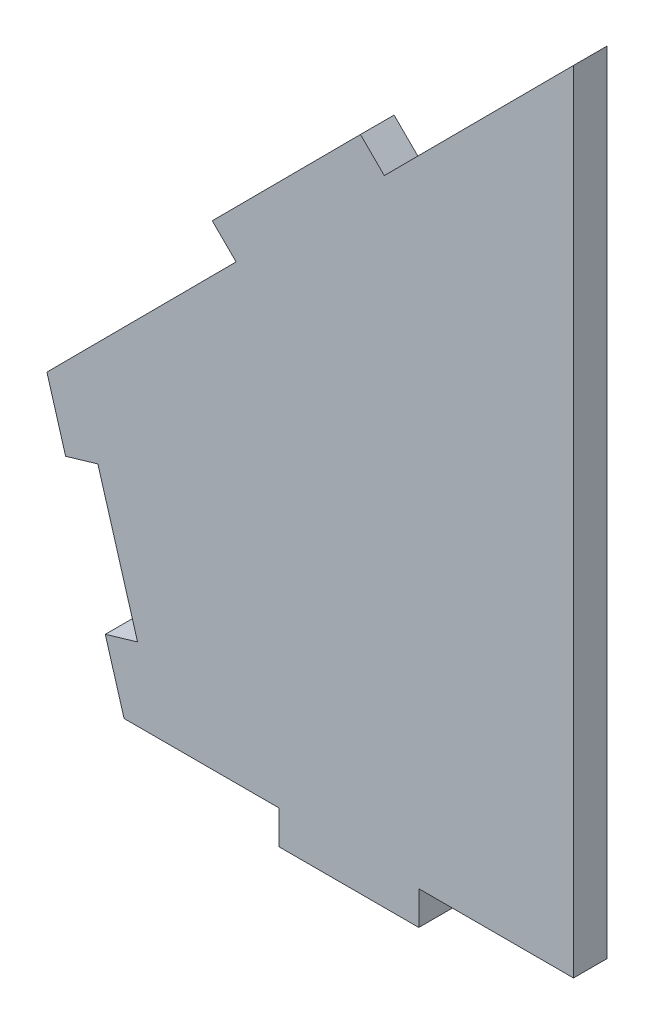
ISO-10303-21;
HEADER;
FILE_DESCRIPTION(('STEP AP214'),'2;1');
FILE_NAME('part.step','',(''),(''),'','','');
FILE_SCHEMA(('AUTOMOTIVE_DESIGN { 1 0 10303 214 1 1 1 1 }'));
ENDSEC;
DATA;
#1=APPLICATION_CONTEXT('core data for automotive mechanical design processes');
#2=APPLICATION_PROTOCOL_DEFINITION('international standard','automotive_design',2000,#1);
#3=PRODUCT_CONTEXT('',#1,'mechanical');
#4=PRODUCT('Part','Part','',(#3));
#5=PRODUCT_RELATED_PRODUCT_CATEGORY('part','',(#4));
#6=PRODUCT_DEFINITION_FORMATION('','',#4);
#7=PRODUCT_DEFINITION_CONTEXT('part definition',#1,'design');
#8=PRODUCT_DEFINITION('design','',#6,#7);
#9=PRODUCT_DEFINITION_SHAPE('','',#8);
#10=(LENGTH_UNIT() NAMED_UNIT(*) SI_UNIT(.MILLI.,.METRE.));
#11=(NAMED_UNIT(*) PLANE_ANGLE_UNIT() SI_UNIT($,.RADIAN.));
#12=(NAMED_UNIT(*) SI_UNIT($,.STERADIAN.) SOLID_ANGLE_UNIT());
#13=UNCERTAINTY_MEASURE_WITH_UNIT(LENGTH_MEASURE(1.E-05),#10,'distance_accuracy_value','');
#14=(GEOMETRIC_REPRESENTATION_CONTEXT(3) GLOBAL_UNCERTAINTY_ASSIGNED_CONTEXT((#13)) GLOBAL_UNIT_ASSIGNED_CONTEXT((#10,
#11,#12)) REPRESENTATION_CONTEXT('',''));
#15=CARTESIAN_POINT('',(0.,0.,0.));
#16=DIRECTION('',(0.,0.,1.));
#17=DIRECTION('',(1.,0.,0.));
#18=AXIS2_PLACEMENT_3D('',#15,#16,#17);
#19=CARTESIAN_POINT('',(-14.8880123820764,0.,1.524));
#20=DIRECTION('',(1.,0.,0.));
#21=DIRECTION('',(0.,0.,-1.));
#22=AXIS2_PLACEMENT_3D('',#19,#20,#21);
#23=PLANE('',#22);
#24=DIRECTION('',(0.,-1.,0.));
#25=VECTOR('',#24,1.);
#26=CARTESIAN_POINT('',(-14.8880123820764,0.,0.));
#27=LINE('',#26,#25);
#28=CARTESIAN_POINT('',(-14.8880123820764,10.5504707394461,0.));
#29=VERTEX_POINT('',#28);
#30=CARTESIAN_POINT('',(-14.8880123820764,9.02647073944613,0.));
#31=VERTEX_POINT('',#30);
#32=EDGE_CURVE('E185',#29,#31,#27,.T.);
#33=ORIENTED_EDGE('',*,*,#32,.T.);
#34=DIRECTION('',(0.,0.,-1.));
#35=VECTOR('',#34,1.);
#36=CARTESIAN_POINT('',(-14.8880123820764,9.02647073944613,1.524));
#37=LINE('',#36,#35);
#38=CARTESIAN_POINT('',(-14.8880123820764,9.02647073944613,1.524));
#39=VERTEX_POINT('',#38);
#40=EDGE_CURVE('E11',#39,#31,#37,.T.);
#41=ORIENTED_EDGE('',*,*,#40,.F.);
#42=DIRECTION('',(0.,-1.,0.));
#43=VECTOR('',#42,1.);
#44=CARTESIAN_POINT('',(-14.8880123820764,0.,1.524));
#45=LINE('',#44,#43);
#46=CARTESIAN_POINT('',(-14.8880123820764,10.5504707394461,1.524));
#47=VERTEX_POINT('',#46);
#48=EDGE_CURVE('E221',#47,#39,#45,.T.);
#49=ORIENTED_EDGE('',*,*,#48,.F.);
#50=DIRECTION('',(0.,0.,-1.));
#51=VECTOR('',#50,1.);
#52=CARTESIAN_POINT('',(-14.8880123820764,10.5504707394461,1.524));
#53=LINE('',#52,#51);
#54=EDGE_CURVE('E184',#47,#29,#53,.T.);
#55=ORIENTED_EDGE('',*,*,#54,.T.);
#56=EDGE_LOOP('',(#33,#41,#49,#55));
#57=FACE_BOUND('',#56,.T.);
#58=ADVANCED_FACE('F40',(#57),#23,.F.);
#59=CARTESIAN_POINT('',(0.,9.02647073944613,1.524));
#60=DIRECTION('',(0.,1.,0.));
#61=DIRECTION('',(0.,0.,1.));
#62=AXIS2_PLACEMENT_3D('',#59,#60,#61);
#63=PLANE('',#62);
#64=DIRECTION('',(1.,0.,0.));
#65=VECTOR('',#64,1.);
#66=CARTESIAN_POINT('',(0.,9.02647073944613,0.));
#67=LINE('',#66,#65);
#68=CARTESIAN_POINT('',(-8.53801238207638,9.02647073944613,0.));
#69=VERTEX_POINT('',#68);
#70=EDGE_CURVE('E188',#31,#69,#67,.T.);
#71=ORIENTED_EDGE('',*,*,#70,.T.);
#72=DIRECTION('',(0.,0.,-1.));
#73=VECTOR('',#72,1.);
#74=CARTESIAN_POINT('',(-8.53801238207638,9.02647073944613,1.524));
#75=LINE('',#74,#73);
#76=CARTESIAN_POINT('',(-8.53801238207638,9.02647073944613,1.524));
#77=VERTEX_POINT('',#76);
#78=EDGE_CURVE('E48',#77,#69,#75,.T.);
#79=ORIENTED_EDGE('',*,*,#78,.F.);
#80=DIRECTION('',(1.,0.,0.));
#81=VECTOR('',#80,1.);
#82=CARTESIAN_POINT('',(0.,9.02647073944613,1.524));
#83=LINE('',#82,#81);
#84=EDGE_CURVE('E122',#39,#77,#83,.T.);
#85=ORIENTED_EDGE('',*,*,#84,.F.);
#86=ORIENTED_EDGE('',*,*,#40,.T.);
#87=EDGE_LOOP('',(#71,#79,#85,#86));
#88=FACE_BOUND('',#87,.T.);
#89=ADVANCED_FACE('F256',(#88),#63,.F.);
#90=CARTESIAN_POINT('',(-8.53801238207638,0.,1.524));
#91=DIRECTION('',(1.,0.,0.));
#92=DIRECTION('',(0.,0.,-1.));
#93=AXIS2_PLACEMENT_3D('',#90,#91,#92);
#94=PLANE('',#93);
#95=DIRECTION('',(0.,-1.,0.));
#96=VECTOR('',#95,1.);
#97=CARTESIAN_POINT('',(-8.53801238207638,0.,0.));
#98=LINE('',#97,#96);
#99=CARTESIAN_POINT('',(-8.53801238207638,10.5504707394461,0.));
#100=VERTEX_POINT('',#99);
#101=EDGE_CURVE('E191',#100,#69,#98,.T.);
#102=ORIENTED_EDGE('',*,*,#101,.F.);
#103=DIRECTION('',(0.,0.,-1.));
#104=VECTOR('',#103,1.);
#105=CARTESIAN_POINT('',(-8.53801238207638,10.5504707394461,1.524));
#106=LINE('',#105,#104);
#107=CARTESIAN_POINT('',(-8.53801238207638,10.5504707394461,1.524));
#108=VERTEX_POINT('',#107);
#109=EDGE_CURVE('E249',#108,#100,#106,.T.);
#110=ORIENTED_EDGE('',*,*,#109,.F.);
#111=DIRECTION('',(0.,-1.,0.));
#112=VECTOR('',#111,1.);
#113=CARTESIAN_POINT('',(-8.53801238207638,0.,1.524));
#114=LINE('',#113,#112);
#115=EDGE_CURVE('E255',#108,#77,#114,.T.);
#116=ORIENTED_EDGE('',*,*,#115,.T.);
#117=ORIENTED_EDGE('',*,*,#78,.T.);
#118=EDGE_LOOP('',(#102,#110,#116,#117));
#119=FACE_BOUND('',#118,.T.);
#120=ADVANCED_FACE('F253',(#119),#94,.T.);
#121=CARTESIAN_POINT('',(0.,10.5504707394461,1.524));
#122=DIRECTION('',(0.,1.,0.));
#123=DIRECTION('',(0.,0.,1.));
#124=AXIS2_PLACEMENT_3D('',#121,#122,#123);
#125=PLANE('',#124);
#126=DIRECTION('',(1.,0.,0.));
#127=VECTOR('',#126,1.);
#128=CARTESIAN_POINT('',(0.,10.5504707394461,0.));
#129=LINE('',#128,#127);
#130=CARTESIAN_POINT('',(-1.524,10.5504707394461,0.));
#131=VERTEX_POINT('',#130);
#132=EDGE_CURVE('E194',#100,#131,#129,.T.);
#133=ORIENTED_EDGE('',*,*,#132,.T.);
#134=DIRECTION('',(0.,0.,-1.));
#135=VECTOR('',#134,1.);
#136=CARTESIAN_POINT('',(-1.524,10.5504707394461,1.524));
#137=LINE('',#136,#135);
#138=CARTESIAN_POINT('',(-1.524,10.5504707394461,1.524));
#139=VERTEX_POINT('',#138);
#140=EDGE_CURVE('E246',#139,#131,#137,.T.);
#141=ORIENTED_EDGE('',*,*,#140,.F.);
#142=DIRECTION('',(1.,0.,0.));
#143=VECTOR('',#142,1.);
#144=CARTESIAN_POINT('',(0.,10.5504707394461,1.524));
#145=LINE('',#144,#143);
#146=EDGE_CURVE('E275',#108,#139,#145,.T.);
#147=ORIENTED_EDGE('',*,*,#146,.F.);
#148=ORIENTED_EDGE('',*,*,#109,.T.);
#149=EDGE_LOOP('',(#133,#141,#147,#148));
#150=FACE_BOUND('',#149,.T.);
#151=ADVANCED_FACE('F266',(#150),#125,.F.);
#152=CARTESIAN_POINT('',(-1.524,0.,1.524));
#153=DIRECTION('',(-1.,0.,0.));
#154=DIRECTION('',(0.,-1.,0.));
#155=AXIS2_PLACEMENT_3D('',#152,#153,#154);
#156=PLANE('',#155);
#157=DIRECTION('',(0.,1.,0.));
#158=VECTOR('',#157,1.);
#159=CARTESIAN_POINT('',(-1.524,0.,0.));
#160=LINE('',#159,#158);
#161=CARTESIAN_POINT('',(-1.524,46.3839410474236,0.));
#162=VERTEX_POINT('',#161);
#163=EDGE_CURVE('E196',#131,#162,#160,.T.);
#164=ORIENTED_EDGE('',*,*,#163,.T.);
#165=DIRECTION('',(0.,0.,-1.));
#166=VECTOR('',#165,1.);
#167=CARTESIAN_POINT('',(-1.524,46.3839410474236,1.524));
#168=LINE('',#167,#166);
#169=CARTESIAN_POINT('',(-1.524,46.3839410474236,1.524));
#170=VERTEX_POINT('',#169);
#171=EDGE_CURVE('E243',#170,#162,#168,.T.);
#172=ORIENTED_EDGE('',*,*,#171,.F.);
#173=DIRECTION('',(0.,1.,0.));
#174=VECTOR('',#173,1.);
#175=CARTESIAN_POINT('',(-1.524,0.,1.524));
#176=LINE('',#175,#174);
#177=EDGE_CURVE('E272',#139,#170,#176,.T.);
#178=ORIENTED_EDGE('',*,*,#177,.F.);
#179=ORIENTED_EDGE('',*,*,#140,.T.);
#180=EDGE_LOOP('',(#164,#172,#178,#179));
#181=FACE_BOUND('',#180,.T.);
#182=ADVANCED_FACE('F270',(#181),#156,.F.);
#183=CARTESIAN_POINT('',(-23.9570480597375,23.8537002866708,1.524));
#184=DIRECTION('',(0.708633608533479,-0.705576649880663,0.));
#185=DIRECTION('',(0.705576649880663,0.708633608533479,0.));
#186=AXIS2_PLACEMENT_3D('',#183,#184,#185);
#187=PLANE('',#186);
#188=DIRECTION('',(-0.705576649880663,-0.708633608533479,0.));
#189=VECTOR('',#188,1.);
#190=CARTESIAN_POINT('',(-23.9570480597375,23.8537002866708,0.));
#191=LINE('',#190,#189);
#192=CARTESIAN_POINT('',(-10.1022613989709,37.7685137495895,0.));
#193=VERTEX_POINT('',#192);
#194=EDGE_CURVE('E198',#162,#193,#191,.T.);
#195=ORIENTED_EDGE('',*,*,#194,.T.);
#196=DIRECTION('',(0.,0.,-1.));
#197=VECTOR('',#196,1.);
#198=CARTESIAN_POINT('',(-10.1022613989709,37.7685137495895,1.524));
#199=LINE('',#198,#197);
#200=CARTESIAN_POINT('',(-10.1022613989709,37.7685137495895,1.524));
#201=VERTEX_POINT('',#200);
#202=EDGE_CURVE('E240',#201,#193,#199,.T.);
#203=ORIENTED_EDGE('',*,*,#202,.F.);
#204=DIRECTION('',(-0.705576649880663,-0.708633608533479,0.));
#205=VECTOR('',#204,1.);
#206=CARTESIAN_POINT('',(-23.9570480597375,23.8537002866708,1.524));
#207=LINE('',#206,#205);
#208=EDGE_CURVE('E274',#170,#201,#207,.T.);
#209=ORIENTED_EDGE('',*,*,#208,.F.);
#210=ORIENTED_EDGE('',*,*,#171,.T.);
#211=EDGE_LOOP('',(#195,#203,#209,#210));
#212=FACE_BOUND('',#211,.T.);
#213=ADVANCED_FACE('F326',(#212),#187,.F.);
#214=CARTESIAN_POINT('',(13.8547866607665,13.9148134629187,1.524));
#215=DIRECTION('',(-0.705576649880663,-0.708633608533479,0.));
#216=DIRECTION('',(0.708633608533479,-0.705576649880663,0.));
#217=AXIS2_PLACEMENT_3D('',#214,#215,#216);
#218=PLANE('',#217);
#219=DIRECTION('',(-0.708633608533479,0.705576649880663,0.));
#220=VECTOR('',#219,1.);
#221=CARTESIAN_POINT('',(13.8547866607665,13.9148134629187,0.));
#222=LINE('',#221,#220);
#223=CARTESIAN_POINT('',(-11.1822190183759,38.8438125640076,0.));
#224=VERTEX_POINT('',#223);
#225=EDGE_CURVE('E200',#193,#224,#222,.T.);
#226=ORIENTED_EDGE('',*,*,#225,.T.);
#227=DIRECTION('',(0.,0.,-1.));
#228=VECTOR('',#227,1.);
#229=CARTESIAN_POINT('',(-11.1822190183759,38.8438125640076,1.524));
#230=LINE('',#229,#228);
#231=CARTESIAN_POINT('',(-11.1822190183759,38.8438125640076,1.524));
#232=VERTEX_POINT('',#231);
#233=EDGE_CURVE('E237',#232,#224,#230,.T.);
#234=ORIENTED_EDGE('',*,*,#233,.F.);
#235=DIRECTION('',(-0.708633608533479,0.705576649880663,0.));
#236=VECTOR('',#235,1.);
#237=CARTESIAN_POINT('',(13.8547866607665,13.9148134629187,1.524));
#238=LINE('',#237,#236);
#239=EDGE_CURVE('E277',#201,#232,#238,.T.);
#240=ORIENTED_EDGE('',*,*,#239,.F.);
#241=ORIENTED_EDGE('',*,*,#202,.T.);
#242=EDGE_LOOP('',(#226,#234,#240,#241));
#243=FACE_BOUND('',#242,.T.);
#244=ADVANCED_FACE('F329',(#243),#218,.F.);
#245=CARTESIAN_POINT('',(-25.0370056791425,24.928999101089,1.524));
#246=DIRECTION('',(0.708633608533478,-0.705576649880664,0.));
#247=DIRECTION('',(0.705576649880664,0.708633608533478,0.));
#248=AXIS2_PLACEMENT_3D('',#245,#246,#247);
#249=PLANE('',#248);
#250=DIRECTION('',(-0.705576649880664,-0.708633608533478,0.));
#251=VECTOR('',#250,1.);
#252=CARTESIAN_POINT('',(-25.0370056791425,24.928999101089,0.));
#253=LINE('',#252,#251);
#254=CARTESIAN_POINT('',(-17.9028366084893,32.0940774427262,0.));
#255=VERTEX_POINT('',#254);
#256=EDGE_CURVE('E202',#224,#255,#253,.T.);
#257=ORIENTED_EDGE('',*,*,#256,.T.);
#258=DIRECTION('',(0.,0.,-1.));
#259=VECTOR('',#258,1.);
#260=CARTESIAN_POINT('',(-17.9028366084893,32.0940774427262,1.524));
#261=LINE('',#260,#259);
#262=CARTESIAN_POINT('',(-17.9028366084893,32.0940774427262,1.524));
#263=VERTEX_POINT('',#262);
#264=EDGE_CURVE('E235',#263,#255,#261,.T.);
#265=ORIENTED_EDGE('',*,*,#264,.F.);
#266=DIRECTION('',(-0.705576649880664,-0.708633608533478,0.));
#267=VECTOR('',#266,1.);
#268=CARTESIAN_POINT('',(-25.0370056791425,24.928999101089,1.524));
#269=LINE('',#268,#267);
#270=EDGE_CURVE('E283',#232,#263,#269,.T.);
#271=ORIENTED_EDGE('',*,*,#270,.F.);
#272=ORIENTED_EDGE('',*,*,#233,.T.);
#273=EDGE_LOOP('',(#257,#265,#271,#272));
#274=FACE_BOUND('',#273,.T.);
#275=ADVANCED_FACE('F333',(#274),#249,.F.);
#276=CARTESIAN_POINT('',(7.1341690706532,7.16507834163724,1.524));
#277=DIRECTION('',(-0.705576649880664,-0.708633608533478,0.));
#278=DIRECTION('',(0.708633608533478,-0.705576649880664,0.));
#279=AXIS2_PLACEMENT_3D('',#276,#277,#278);
#280=PLANE('',#279);
#281=DIRECTION('',(-0.708633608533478,0.705576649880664,0.));
#282=VECTOR('',#281,1.);
#283=CARTESIAN_POINT('',(7.1341690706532,7.16507834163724,0.));
#284=LINE('',#283,#282);
#285=CARTESIAN_POINT('',(-16.8228789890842,31.0187786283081,0.));
#286=VERTEX_POINT('',#285);
#287=EDGE_CURVE('E205',#286,#255,#284,.T.);
#288=ORIENTED_EDGE('',*,*,#287,.F.);
#289=DIRECTION('',(0.,0.,-1.));
#290=VECTOR('',#289,1.);
#291=CARTESIAN_POINT('',(-16.8228789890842,31.0187786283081,1.524));
#292=LINE('',#291,#290);
#293=CARTESIAN_POINT('',(-16.8228789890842,31.0187786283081,1.524));
#294=VERTEX_POINT('',#293);
#295=EDGE_CURVE('E233',#294,#286,#292,.T.);
#296=ORIENTED_EDGE('',*,*,#295,.F.);
#297=DIRECTION('',(-0.708633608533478,0.705576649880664,0.));
#298=VECTOR('',#297,1.);
#299=CARTESIAN_POINT('',(7.1341690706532,7.16507834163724,1.524));
#300=LINE('',#299,#298);
#301=EDGE_CURVE('E285',#294,#263,#300,.T.);
#302=ORIENTED_EDGE('',*,*,#301,.T.);
#303=ORIENTED_EDGE('',*,*,#264,.T.);
#304=EDGE_LOOP('',(#288,#296,#302,#303));
#305=FACE_BOUND('',#304,.T.);
#306=ADVANCED_FACE('F337',(#305),#280,.T.);
#307=CARTESIAN_POINT('',(-23.9570480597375,23.8537002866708,1.524));
#308=DIRECTION('',(0.708633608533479,-0.705576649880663,0.));
#309=DIRECTION('',(0.705576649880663,0.708633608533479,0.));
#310=AXIS2_PLACEMENT_3D('',#307,#308,#309);
#311=PLANE('',#310);
#312=DIRECTION('',(-0.705576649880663,-0.708633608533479,0.));
#313=VECTOR('',#312,1.);
#314=CARTESIAN_POINT('',(-23.9570480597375,23.8537002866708,0.));
#315=LINE('',#314,#313);
#316=CARTESIAN_POINT('',(-25.4011403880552,22.403351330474,0.));
#317=VERTEX_POINT('',#316);
#318=EDGE_CURVE('E208',#286,#317,#315,.T.);
#319=ORIENTED_EDGE('',*,*,#318,.T.);
#320=DIRECTION('',(0.,0.,-1.));
#321=VECTOR('',#320,1.);
#322=CARTESIAN_POINT('',(-25.4011403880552,22.403351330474,1.524));
#323=LINE('',#322,#321);
#324=CARTESIAN_POINT('',(-25.4011403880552,22.403351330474,1.524));
#325=VERTEX_POINT('',#324);
#326=EDGE_CURVE('E230',#325,#317,#323,.T.);
#327=ORIENTED_EDGE('',*,*,#326,.F.);
#328=DIRECTION('',(-0.705576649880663,-0.708633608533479,0.));
#329=VECTOR('',#328,1.);
#330=CARTESIAN_POINT('',(-23.9570480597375,23.8537002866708,1.524));
#331=LINE('',#330,#329);
#332=EDGE_CURVE('E288',#294,#325,#331,.T.);
#333=ORIENTED_EDGE('',*,*,#332,.F.);
#334=ORIENTED_EDGE('',*,*,#295,.T.);
#335=EDGE_LOOP('',(#319,#327,#333,#334));
#336=FACE_BOUND('',#335,.T.);
#337=ADVANCED_FACE('F341',(#336),#311,.F.);
#338=CARTESIAN_POINT('',(-17.2813243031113,-5.10165874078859,1.524));
#339=DIRECTION('',(0.959080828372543,0.283132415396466,0.));
#340=DIRECTION('',(-0.283132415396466,0.959080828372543,0.));
#341=AXIS2_PLACEMENT_3D('',#338,#339,#340);
#342=PLANE('',#341);
#343=DIRECTION('',(0.283132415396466,-0.959080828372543,0.));
#344=VECTOR('',#343,1.);
#345=CARTESIAN_POINT('',(-17.2813243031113,-5.10165874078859,0.));
#346=LINE('',#345,#344);
#347=CARTESIAN_POINT('',(-24.5505279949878,19.5219926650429,0.));
#348=VERTEX_POINT('',#347);
#349=EDGE_CURVE('E210',#317,#348,#346,.T.);
#350=ORIENTED_EDGE('',*,*,#349,.T.);
#351=DIRECTION('',(0.,0.,-1.));
#352=VECTOR('',#351,1.);
#353=CARTESIAN_POINT('',(-24.5505279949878,19.5219926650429,1.524));
#354=LINE('',#353,#352);
#355=CARTESIAN_POINT('',(-24.5505279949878,19.5219926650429,1.524));
#356=VERTEX_POINT('',#355);
#357=EDGE_CURVE('E227',#356,#348,#354,.T.);
#358=ORIENTED_EDGE('',*,*,#357,.F.);
#359=DIRECTION('',(0.283132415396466,-0.959080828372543,0.));
#360=VECTOR('',#359,1.);
#361=CARTESIAN_POINT('',(-17.2813243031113,-5.10165874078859,1.524));
#362=LINE('',#361,#360);
#363=EDGE_CURVE('E290',#325,#356,#362,.T.);
#364=ORIENTED_EDGE('',*,*,#363,.F.);
#365=ORIENTED_EDGE('',*,*,#326,.T.);
#366=EDGE_LOOP('',(#350,#358,#364,#365));
#367=FACE_BOUND('',#366,.T.);
#368=ADVANCED_FACE('F345',(#367),#342,.F.);
#369=CARTESIAN_POINT('',(-7.26920369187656,24.6236514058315,1.524));
#370=DIRECTION('',(-0.283132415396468,0.959080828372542,0.));
#371=DIRECTION('',(-0.959080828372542,-0.283132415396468,0.));
#372=AXIS2_PLACEMENT_3D('',#369,#370,#371);
#373=PLANE('',#372);
#374=DIRECTION('',(0.959080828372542,0.283132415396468,0.));
#375=VECTOR('',#374,1.);
#376=CARTESIAN_POINT('',(-7.26920369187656,24.6236514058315,0.));
#377=LINE('',#376,#375);
#378=CARTESIAN_POINT('',(-23.088888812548,19.9534864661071,0.));
#379=VERTEX_POINT('',#378);
#380=EDGE_CURVE('E212',#348,#379,#377,.T.);
#381=ORIENTED_EDGE('',*,*,#380,.T.);
#382=DIRECTION('',(0.,0.,-1.));
#383=VECTOR('',#382,1.);
#384=CARTESIAN_POINT('',(-23.088888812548,19.9534864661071,1.524));
#385=LINE('',#384,#383);
#386=CARTESIAN_POINT('',(-23.088888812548,19.9534864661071,1.524));
#387=VERTEX_POINT('',#386);
#388=EDGE_CURVE('E225',#387,#379,#385,.T.);
#389=ORIENTED_EDGE('',*,*,#388,.F.);
#390=DIRECTION('',(0.959080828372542,0.283132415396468,0.));
#391=VECTOR('',#390,1.);
#392=CARTESIAN_POINT('',(-7.26920369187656,24.6236514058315,1.524));
#393=LINE('',#392,#391);
#394=EDGE_CURVE('E179',#356,#387,#393,.T.);
#395=ORIENTED_EDGE('',*,*,#394,.F.);
#396=ORIENTED_EDGE('',*,*,#357,.T.);
#397=EDGE_LOOP('',(#381,#389,#395,#396));
#398=FACE_BOUND('',#397,.T.);
#399=ADVANCED_FACE('F296',(#398),#373,.F.);
#400=CARTESIAN_POINT('',(-15.8196851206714,-4.67016493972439,1.524));
#401=DIRECTION('',(-0.959080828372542,-0.283132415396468,0.));
#402=DIRECTION('',(0.283132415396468,-0.959080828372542,0.));
#403=AXIS2_PLACEMENT_3D('',#400,#401,#402);
#404=PLANE('',#403);
#405=DIRECTION('',(-0.283132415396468,0.959080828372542,0.));
#406=VECTOR('',#405,1.);
#407=CARTESIAN_POINT('',(-15.8196851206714,-4.67016493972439,0.));
#408=LINE('',#407,#406);
#409=CARTESIAN_POINT('',(-21.2909979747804,13.8633232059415,0.));
#410=VERTEX_POINT('',#409);
#411=EDGE_CURVE('E215',#410,#379,#408,.T.);
#412=ORIENTED_EDGE('',*,*,#411,.F.);
#413=DIRECTION('',(0.,0.,-1.));
#414=VECTOR('',#413,1.);
#415=CARTESIAN_POINT('',(-21.2909979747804,13.8633232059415,1.524));
#416=LINE('',#415,#414);
#417=CARTESIAN_POINT('',(-21.2909979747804,13.8633232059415,1.524));
#418=VERTEX_POINT('',#417);
#419=EDGE_CURVE('E168',#418,#410,#416,.T.);
#420=ORIENTED_EDGE('',*,*,#419,.F.);
#421=DIRECTION('',(-0.283132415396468,0.959080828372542,0.));
#422=VECTOR('',#421,1.);
#423=CARTESIAN_POINT('',(-15.8196851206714,-4.67016493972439,1.524));
#424=LINE('',#423,#422);
#425=EDGE_CURVE('E177',#418,#387,#424,.T.);
#426=ORIENTED_EDGE('',*,*,#425,.T.);
#427=ORIENTED_EDGE('',*,*,#388,.T.);
#428=EDGE_LOOP('',(#412,#420,#426,#427));
#429=FACE_BOUND('',#428,.T.);
#430=ADVANCED_FACE('F300',(#429),#404,.T.);
#431=CARTESIAN_POINT('',(-5.47131285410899,18.5334881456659,1.524));
#432=DIRECTION('',(-0.283132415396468,0.959080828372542,0.));
#433=DIRECTION('',(-0.959080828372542,-0.283132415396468,0.));
#434=AXIS2_PLACEMENT_3D('',#431,#432,#433);
#435=PLANE('',#434);
#436=DIRECTION('',(0.959080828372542,0.283132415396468,0.));
#437=VECTOR('',#436,1.);
#438=CARTESIAN_POINT('',(-5.47131285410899,18.5334881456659,0.));
#439=LINE('',#438,#437);
#440=CARTESIAN_POINT('',(-22.7526371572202,13.4318294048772,0.));
#441=VERTEX_POINT('',#440);
#442=EDGE_CURVE('E167',#441,#410,#439,.T.);
#443=ORIENTED_EDGE('',*,*,#442,.F.);
#444=DIRECTION('',(0.,0.,-1.));
#445=VECTOR('',#444,1.);
#446=CARTESIAN_POINT('',(-22.7526371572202,13.4318294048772,1.524));
#447=LINE('',#446,#445);
#448=CARTESIAN_POINT('',(-22.7526371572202,13.4318294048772,1.524));
#449=VERTEX_POINT('',#448);
#450=EDGE_CURVE('E161',#449,#441,#447,.T.);
#451=ORIENTED_EDGE('',*,*,#450,.F.);
#452=DIRECTION('',(0.959080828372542,0.283132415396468,0.));
#453=VECTOR('',#452,1.);
#454=CARTESIAN_POINT('',(-5.47131285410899,18.5334881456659,1.524));
#455=LINE('',#454,#453);
#456=EDGE_CURVE('E165',#449,#418,#455,.T.);
#457=ORIENTED_EDGE('',*,*,#456,.T.);
#458=ORIENTED_EDGE('',*,*,#419,.T.);
#459=EDGE_LOOP('',(#443,#451,#457,#458));
#460=FACE_BOUND('',#459,.T.);
#461=ADVANCED_FACE('F163',(#460),#435,.T.);
#462=CARTESIAN_POINT('',(-17.2813243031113,-5.10165874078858,1.524));
#463=DIRECTION('',(0.959080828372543,0.283132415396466,0.));
#464=DIRECTION('',(-0.283132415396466,0.959080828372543,0.));
#465=AXIS2_PLACEMENT_3D('',#462,#463,#464);
#466=PLANE('',#465);
#467=DIRECTION('',(0.283132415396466,-0.959080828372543,0.));
#468=VECTOR('',#467,1.);
#469=CARTESIAN_POINT('',(-17.2813243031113,-5.10165874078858,0.));
#470=LINE('',#469,#468);
#471=CARTESIAN_POINT('',(-21.9020247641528,10.5504707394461,0.));
#472=VERTEX_POINT('',#471);
#473=EDGE_CURVE('E108',#441,#472,#470,.T.);
#474=ORIENTED_EDGE('',*,*,#473,.T.);
#475=DIRECTION('',(0.,0.,-1.));
#476=VECTOR('',#475,1.);
#477=CARTESIAN_POINT('',(-21.9020247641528,10.5504707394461,1.524));
#478=LINE('',#477,#476);
#479=CARTESIAN_POINT('',(-21.9020247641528,10.5504707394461,1.524));
#480=VERTEX_POINT('',#479);
#481=EDGE_CURVE('E169',#480,#472,#478,.T.);
#482=ORIENTED_EDGE('',*,*,#481,.F.);
#483=DIRECTION('',(0.283132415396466,-0.959080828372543,0.));
#484=VECTOR('',#483,1.);
#485=CARTESIAN_POINT('',(-17.2813243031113,-5.10165874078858,1.524));
#486=LINE('',#485,#484);
#487=EDGE_CURVE('E171',#449,#480,#486,.T.);
#488=ORIENTED_EDGE('',*,*,#487,.F.);
#489=ORIENTED_EDGE('',*,*,#450,.T.);
#490=EDGE_LOOP('',(#474,#482,#488,#489));
#491=FACE_BOUND('',#490,.T.);
#492=ADVANCED_FACE('F172',(#491),#466,.F.);
#493=CARTESIAN_POINT('',(0.,10.5504707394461,1.524));
#494=DIRECTION('',(0.,1.,0.));
#495=DIRECTION('',(0.,0.,1.));
#496=AXIS2_PLACEMENT_3D('',#493,#494,#495);
#497=PLANE('',#496);
#498=DIRECTION('',(1.,0.,0.));
#499=VECTOR('',#498,1.);
#500=CARTESIAN_POINT('',(0.,10.5504707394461,0.));
#501=LINE('',#500,#499);
#502=EDGE_CURVE('E114',#472,#29,#501,.T.);
#503=ORIENTED_EDGE('',*,*,#502,.T.);
#504=ORIENTED_EDGE('',*,*,#54,.F.);
#505=DIRECTION('',(1.,0.,0.));
#506=VECTOR('',#505,1.);
#507=CARTESIAN_POINT('',(0.,10.5504707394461,1.524));
#508=LINE('',#507,#506);
#509=EDGE_CURVE('E56',#480,#47,#508,.T.);
#510=ORIENTED_EDGE('',*,*,#509,.F.);
#511=ORIENTED_EDGE('',*,*,#481,.T.);
#512=EDGE_LOOP('',(#503,#504,#510,#511));
#513=FACE_BOUND('',#512,.T.);
#514=ADVANCED_FACE('F303',(#513),#497,.F.);
#515=CARTESIAN_POINT('',(0.,0.,1.524));
#516=DIRECTION('',(0.,0.,1.));
#517=DIRECTION('',(1.,0.,0.));
#518=AXIS2_PLACEMENT_3D('',#515,#516,#517);
#519=PLANE('',#518);
#520=ORIENTED_EDGE('',*,*,#48,.T.);
#521=ORIENTED_EDGE('',*,*,#84,.T.);
#522=ORIENTED_EDGE('',*,*,#115,.F.);
#523=ORIENTED_EDGE('',*,*,#146,.T.);
#524=ORIENTED_EDGE('',*,*,#177,.T.);
#525=ORIENTED_EDGE('',*,*,#208,.T.);
#526=ORIENTED_EDGE('',*,*,#239,.T.);
#527=ORIENTED_EDGE('',*,*,#270,.T.);
#528=ORIENTED_EDGE('',*,*,#301,.F.);
#529=ORIENTED_EDGE('',*,*,#332,.T.);
#530=ORIENTED_EDGE('',*,*,#363,.T.);
#531=ORIENTED_EDGE('',*,*,#394,.T.);
#532=ORIENTED_EDGE('',*,*,#425,.F.);
#533=ORIENTED_EDGE('',*,*,#456,.F.);
#534=ORIENTED_EDGE('',*,*,#487,.T.);
#535=ORIENTED_EDGE('',*,*,#509,.T.);
#536=EDGE_LOOP('',(#520,#521,#522,#523,#524,#525,#526,#527,#528,#529,#530,#531,#532,#533,#534,#535));
#537=FACE_BOUND('',#536,.T.);
#538=ADVANCED_FACE('F175',(#537),#519,.T.);
#539=CARTESIAN_POINT('',(0.,0.,0.));
#540=DIRECTION('',(0.,0.,1.));
#541=DIRECTION('',(1.,0.,0.));
#542=AXIS2_PLACEMENT_3D('',#539,#540,#541);
#543=PLANE('',#542);
#544=ORIENTED_EDGE('',*,*,#32,.F.);
#545=ORIENTED_EDGE('',*,*,#502,.F.);
#546=ORIENTED_EDGE('',*,*,#473,.F.);
#547=ORIENTED_EDGE('',*,*,#442,.T.);
#548=ORIENTED_EDGE('',*,*,#411,.T.);
#549=ORIENTED_EDGE('',*,*,#380,.F.);
#550=ORIENTED_EDGE('',*,*,#349,.F.);
#551=ORIENTED_EDGE('',*,*,#318,.F.);
#552=ORIENTED_EDGE('',*,*,#287,.T.);
#553=ORIENTED_EDGE('',*,*,#256,.F.);
#554=ORIENTED_EDGE('',*,*,#225,.F.);
#555=ORIENTED_EDGE('',*,*,#194,.F.);
#556=ORIENTED_EDGE('',*,*,#163,.F.);
#557=ORIENTED_EDGE('',*,*,#132,.F.);
#558=ORIENTED_EDGE('',*,*,#101,.T.);
#559=ORIENTED_EDGE('',*,*,#70,.F.);
#560=EDGE_LOOP('',(#544,#545,#546,#547,#548,#549,#550,#551,#552,#553,#554,#555,#556,#557,#558,#559));
#561=FACE_BOUND('',#560,.T.);
#562=ADVANCED_FACE('F261',(#561),#543,.F.);
#563=CLOSED_SHELL('',(#58,#89,#120,#151,#182,#213,#244,#275,#306,#337,#368,#399,#430,#461,#492,
#514,#538,#562));
#564=MANIFOLD_SOLID_BREP('B2',#563);
#565=ADVANCED_BREP_SHAPE_REPRESENTATION('',(#18,#564),#14);
#566=SHAPE_DEFINITION_REPRESENTATION(#9,#565);
ENDSEC;
END-ISO-10303-21;
